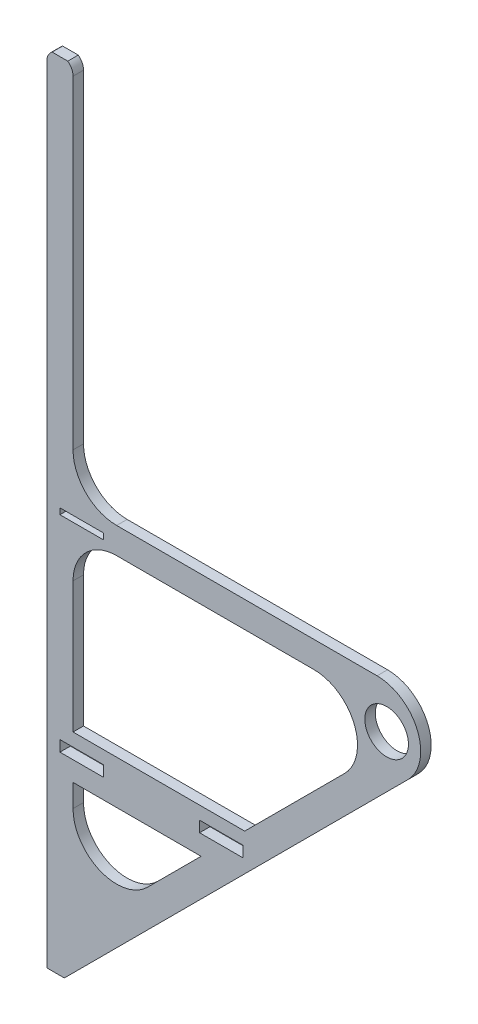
from build123d import *

# Parameters (mm, degrees)
SKETCH1_R           = 25
SKETCH1_W           = 50
SKETCH1_H           = 6.854856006
BOSS_EXTRUDE2_DEPTH = 12
SKETCH2_W           = 50
SKETCH2_H           = 12.5
CUT_EXTRUDE1_DEPTH  = 12


with BuildPart() as part:
    # Sketch1 → Boss-Extrude2 (new body)
    with BuildSketch(Plane.XY):
        with BuildLine():
            Line((0, 450), (0, 0))
            Line((0, 0), (20, 0))
            Line((20, 0), (413.794239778, 393.794239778))
            ThreePointArc((413.794239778, 393.794239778), (424.632877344, 448.283750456), (378.438900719, 479.149578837))
            Line((378.438900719, 479.149578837), (80, 479.149578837))
            ThreePointArc((80, 479.149578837), (44.644660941, 493.794239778), (30, 529.149578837))
            Line((30, 529.149578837), (30, 900))
            ThreePointArc((30, 900), (28.416407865, 906.708203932), (24, 912))
            Line((24, 912), (6, 912))
            ThreePointArc((6, 912), (1.583592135, 906.708203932), (0, 900))
            Line((0, 900), (0, 450))
        make_face()
        with Locations((389.394289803, 429.149578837)):
            Circle(SKETCH1_R, mode=Mode.SUBTRACT)
        with BuildLine():
            Line((80, 449.149578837), (306.012493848, 449.149578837))
            ThreePointArc((306.012493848, 449.149578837), (352.206470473, 418.283750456), (341.367832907, 363.794239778))
            Line((341.367832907, 363.794239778), (226.723171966, 249.149578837))
            Line((226.723171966, 249.149578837), (30, 249.149578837))
            Line((30, 249.149578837), (30, 399.149578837))
            ThreePointArc((30, 399.149578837), (44.644660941, 434.504917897), (80, 449.149578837))
        make_face(mode=Mode.SUBTRACT)
        with BuildLine():
            Line((30, 173.13708499), (30, 199.149578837))
            Line((30, 199.149578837), (176.723171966, 199.149578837))
            Line((176.723171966, 199.149578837), (115.355339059, 137.781745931))
            ThreePointArc((115.355339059, 137.781745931), (60.865828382, 126.943108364), (30, 173.13708499))
        make_face(mode=Mode.SUBTRACT)
        with Locations((40, 460.722150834)):
            Rectangle(SKETCH1_W, SKETCH1_H, mode=Mode.SUBTRACT)
    extrude(amount=BOSS_EXTRUDE2_DEPTH)

    # Sketch2 → Cut-Extrude1 (cut)
    with BuildSketch(Plane.XY.offset(12)):
        with Locations((40, 227.899578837)):
            Rectangle(SKETCH2_W, SKETCH2_H)
        with Locations((200, 227.899578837)):
            Rectangle(SKETCH2_W, SKETCH2_H)
    extrude(amount=-CUT_EXTRUDE1_DEPTH, mode=Mode.SUBTRACT)


solid = part.part
